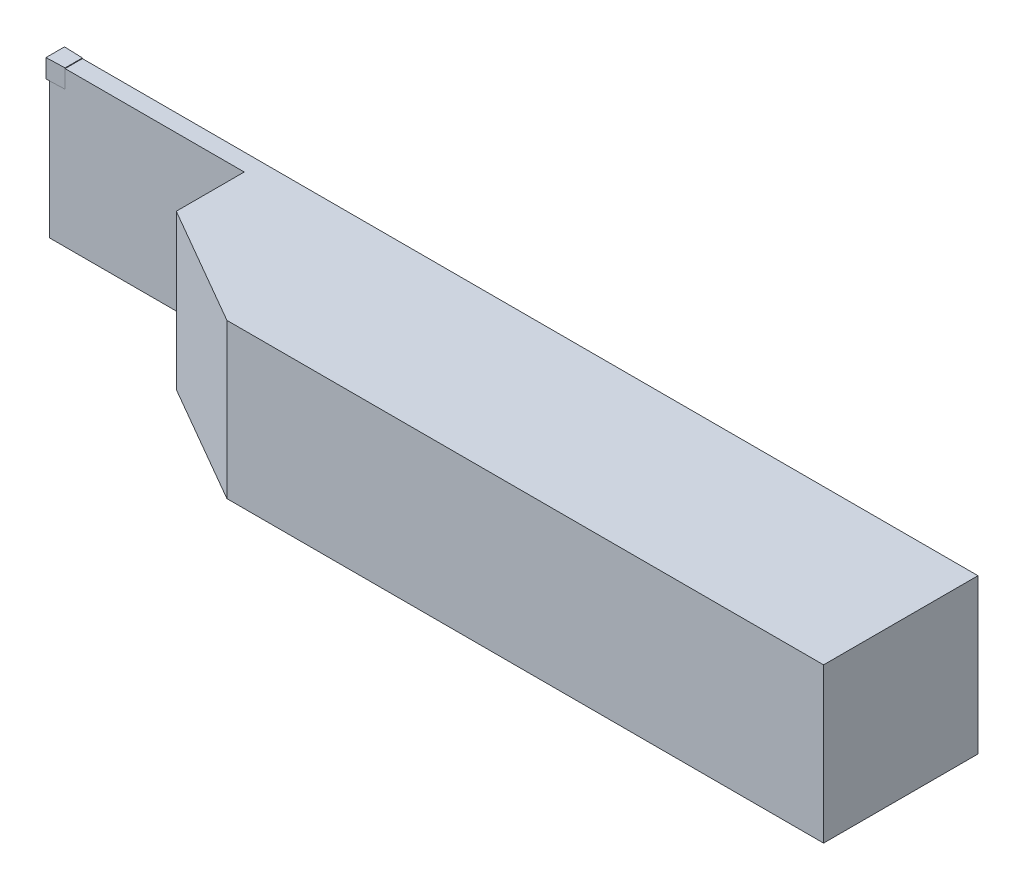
from build123d import *

# Parameters (mm, degrees)
PLAQUETTE_DEPTH  = 3
CORPSOUTIL_DEPTH = 25


with BuildPart() as part:
    # EsqPlaquette → Plaquette (new body)
    with BuildSketch(Plane(origin=(0, 0, 0), x_dir=(1, 0, 0), z_dir=(0, 1, 0))):
        with BuildLine():
            Line((0, -0.010338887), (0, -2.989661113))
            ThreePointArc((0, -2.989661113), (0.003047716, -2.996849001), (0.010333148, -2.999655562))
            Line((0.010333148, -2.999655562), (2.990333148, -2.900322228))
            ThreePointArc((2.990333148, -2.900322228), (2.997187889, -2.897280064), (3, -2.890327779))
            Line((3, -2.890327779), (3, -0.109672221))
            ThreePointArc((3, -0.109672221), (2.997187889, -0.102719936), (2.990333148, -0.099677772))
            Line((2.990333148, -0.099677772), (0.010333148, -0.000344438))
            ThreePointArc((0.010333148, -0.000344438), (0.003047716, -0.003150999), (0, -0.010338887))
        make_face()
    extrude(amount=-PLAQUETTE_DEPTH)

    # EsqCorps → CorpsOutil (add)
    with BuildSketch(Plane(origin=(0, -0.1, 0), x_dir=(-1, 0, 0), z_dir=(0, 1, 0))):
        Polygon((-0.5, 0.1), (-148, 0.1), (-148, 25.1), (-51.398969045, 25.1), (-32, 13.9), (-32, 2.9), (-0.5, 2.9), align=None)
    extrude(amount=-CORPSOUTIL_DEPTH)


solid = part.part
